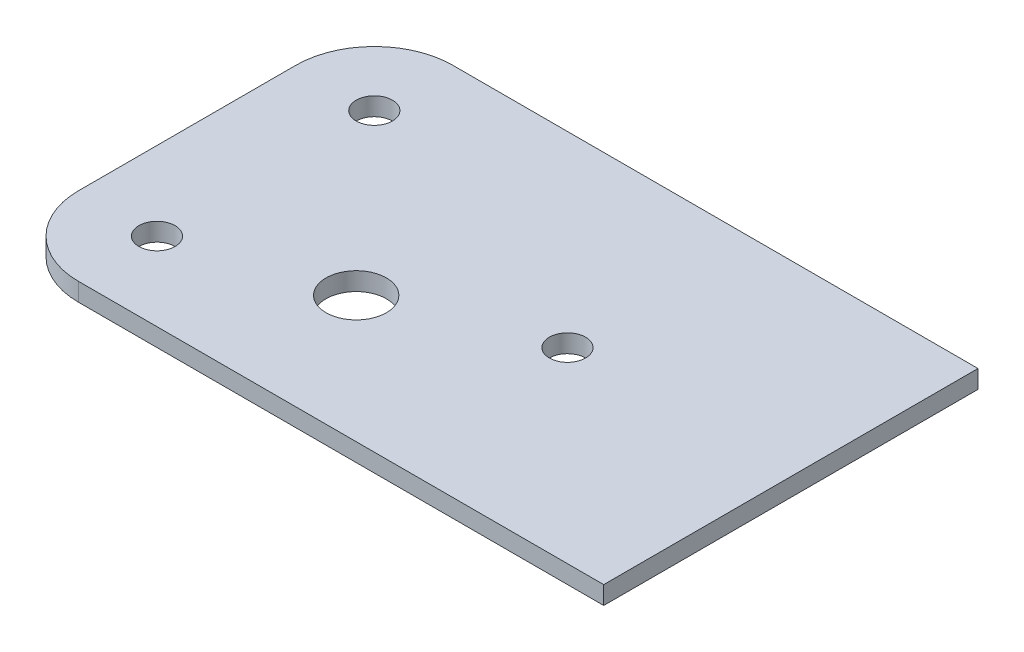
ISO-10303-21;
HEADER;
FILE_DESCRIPTION(('STEP AP214'),'2;1');
FILE_NAME('part.step','',(''),(''),'','','');
FILE_SCHEMA(('AUTOMOTIVE_DESIGN { 1 0 10303 214 1 1 1 1 }'));
ENDSEC;
DATA;
#1=APPLICATION_CONTEXT('core data for automotive mechanical design processes');
#2=APPLICATION_PROTOCOL_DEFINITION('international standard','automotive_design',2000,#1);
#3=PRODUCT_CONTEXT('',#1,'mechanical');
#4=PRODUCT('Part','Part','',(#3));
#5=PRODUCT_RELATED_PRODUCT_CATEGORY('part','',(#4));
#6=PRODUCT_DEFINITION_FORMATION('','',#4);
#7=PRODUCT_DEFINITION_CONTEXT('part definition',#1,'design');
#8=PRODUCT_DEFINITION('design','',#6,#7);
#9=PRODUCT_DEFINITION_SHAPE('','',#8);
#10=(LENGTH_UNIT() NAMED_UNIT(*) SI_UNIT(.MILLI.,.METRE.));
#11=(NAMED_UNIT(*) PLANE_ANGLE_UNIT() SI_UNIT($,.RADIAN.));
#12=(NAMED_UNIT(*) SI_UNIT($,.STERADIAN.) SOLID_ANGLE_UNIT());
#13=UNCERTAINTY_MEASURE_WITH_UNIT(LENGTH_MEASURE(1.E-05),#10,'distance_accuracy_value','');
#14=(GEOMETRIC_REPRESENTATION_CONTEXT(3) GLOBAL_UNCERTAINTY_ASSIGNED_CONTEXT((#13)) GLOBAL_UNIT_ASSIGNED_CONTEXT((#10,
#11,#12)) REPRESENTATION_CONTEXT('',''));
#15=CARTESIAN_POINT('',(0.,0.,0.));
#16=DIRECTION('',(0.,0.,1.));
#17=DIRECTION('',(1.,0.,0.));
#18=AXIS2_PLACEMENT_3D('',#15,#16,#17);
#19=CARTESIAN_POINT('',(13.,3.,-49.));
#20=DIRECTION('',(0.,-1.,0.));
#21=DIRECTION('',(0.,0.,-1.));
#22=AXIS2_PLACEMENT_3D('',#19,#20,#21);
#23=PLANE('',#22);
#24=CARTESIAN_POINT('',(38.,3.,-21.));
#25=DIRECTION('',(0.,1.,0.));
#26=DIRECTION('',(0.,0.,1.));
#27=AXIS2_PLACEMENT_3D('',#24,#25,#26);
#28=CIRCLE('',#27,5.);
#29=CARTESIAN_POINT('',(38.,3.,-16.));
#30=VERTEX_POINT('',#29);
#31=EDGE_CURVE('E196',#30,#30,#28,.T.);
#32=ORIENTED_EDGE('',*,*,#31,.F.);
#33=EDGE_LOOP('',(#32));
#34=FACE_BOUND('',#33,.T.);
#35=CARTESIAN_POINT('',(13.,3.,-49.));
#36=DIRECTION('',(0.,1.,0.));
#37=DIRECTION('',(0.,0.,1.));
#38=AXIS2_PLACEMENT_3D('',#35,#36,#37);
#39=CIRCLE('',#38,3.);
#40=CARTESIAN_POINT('',(13.,3.,-46.));
#41=VERTEX_POINT('',#40);
#42=EDGE_CURVE('E102',#41,#41,#39,.T.);
#43=ORIENTED_EDGE('',*,*,#42,.F.);
#44=EDGE_LOOP('',(#43));
#45=FACE_BOUND('',#44,.T.);
#46=DIRECTION('',(0.,0.,-1.));
#47=VECTOR('',#46,1.);
#48=CARTESIAN_POINT('',(100.,3.,0.));
#49=LINE('',#48,#47);
#50=CARTESIAN_POINT('',(100.,3.,0.));
#51=VERTEX_POINT('',#50);
#52=CARTESIAN_POINT('',(100.,3.,-62.));
#53=VERTEX_POINT('',#52);
#54=EDGE_CURVE('E116',#51,#53,#49,.T.);
#55=ORIENTED_EDGE('',*,*,#54,.T.);
#56=DIRECTION('',(-1.,0.,0.));
#57=VECTOR('',#56,1.);
#58=CARTESIAN_POINT('',(13.0000000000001,3.,-62.));
#59=LINE('',#58,#57);
#60=CARTESIAN_POINT('',(13.0000000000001,3.,-62.));
#61=VERTEX_POINT('',#60);
#62=EDGE_CURVE('E97',#53,#61,#59,.T.);
#63=ORIENTED_EDGE('',*,*,#62,.T.);
#64=CARTESIAN_POINT('',(13.,3.,-49.));
#65=DIRECTION('',(0.,1.,0.));
#66=DIRECTION('',(0.,0.,-1.));
#67=AXIS2_PLACEMENT_3D('',#64,#65,#66);
#68=CIRCLE('',#67,13.);
#69=CARTESIAN_POINT('',(0.,3.,-48.9999999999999));
#70=VERTEX_POINT('',#69);
#71=EDGE_CURVE('E119',#61,#70,#68,.T.);
#72=ORIENTED_EDGE('',*,*,#71,.T.);
#73=DIRECTION('',(0.,0.,1.));
#74=VECTOR('',#73,1.);
#75=CARTESIAN_POINT('',(0.,3.,-13.0000000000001));
#76=LINE('',#75,#74);
#77=CARTESIAN_POINT('',(0.,3.,-13.0000000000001));
#78=VERTEX_POINT('',#77);
#79=EDGE_CURVE('E121',#70,#78,#76,.T.);
#80=ORIENTED_EDGE('',*,*,#79,.T.);
#81=CARTESIAN_POINT('',(13.,3.,-13.));
#82=DIRECTION('',(0.,1.,0.));
#83=DIRECTION('',(0.,0.,-1.));
#84=AXIS2_PLACEMENT_3D('',#81,#82,#83);
#85=CIRCLE('',#84,13.);
#86=CARTESIAN_POINT('',(13.0000000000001,3.,0.));
#87=VERTEX_POINT('',#86);
#88=EDGE_CURVE('E50',#78,#87,#85,.T.);
#89=ORIENTED_EDGE('',*,*,#88,.T.);
#90=DIRECTION('',(1.,0.,0.));
#91=VECTOR('',#90,1.);
#92=CARTESIAN_POINT('',(13.0000000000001,3.,0.));
#93=LINE('',#92,#91);
#94=EDGE_CURVE('E45',#87,#51,#93,.T.);
#95=ORIENTED_EDGE('',*,*,#94,.T.);
#96=EDGE_LOOP('',(#55,#63,#72,#80,#89,#95));
#97=FACE_BOUND('',#96,.T.);
#98=CARTESIAN_POINT('',(13.,3.,-13.));
#99=DIRECTION('',(0.,1.,0.));
#100=DIRECTION('',(0.,0.,1.));
#101=AXIS2_PLACEMENT_3D('',#98,#99,#100);
#102=CIRCLE('',#101,3.);
#103=CARTESIAN_POINT('',(13.,3.,-10.));
#104=VERTEX_POINT('',#103);
#105=EDGE_CURVE('E202',#104,#104,#102,.T.);
#106=ORIENTED_EDGE('',*,*,#105,.F.);
#107=EDGE_LOOP('',(#106));
#108=FACE_BOUND('',#107,.T.);
#109=CARTESIAN_POINT('',(63.,3.,-31.));
#110=DIRECTION('',(0.,1.,0.));
#111=DIRECTION('',(0.,0.,1.));
#112=AXIS2_PLACEMENT_3D('',#109,#110,#111);
#113=CIRCLE('',#112,3.00000000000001);
#114=CARTESIAN_POINT('',(63.,3.,-28.));
#115=VERTEX_POINT('',#114);
#116=EDGE_CURVE('E185',#115,#115,#113,.T.);
#117=ORIENTED_EDGE('',*,*,#116,.F.);
#118=EDGE_LOOP('',(#117));
#119=FACE_BOUND('',#118,.T.);
#120=ADVANCED_FACE('F30',(#34,#45,#97,#108,#119),#23,.F.);
#121=CARTESIAN_POINT('',(13.,0.,-49.));
#122=DIRECTION('',(0.,-1.,0.));
#123=DIRECTION('',(0.,0.,-1.));
#124=AXIS2_PLACEMENT_3D('',#121,#122,#123);
#125=PLANE('',#124);
#126=CARTESIAN_POINT('',(38.,0.,-21.));
#127=DIRECTION('',(0.,1.,0.));
#128=DIRECTION('',(0.,0.,1.));
#129=AXIS2_PLACEMENT_3D('',#126,#127,#128);
#130=CIRCLE('',#129,5.);
#131=CARTESIAN_POINT('',(38.,0.,-16.));
#132=VERTEX_POINT('',#131);
#133=EDGE_CURVE('E191',#132,#132,#130,.T.);
#134=ORIENTED_EDGE('',*,*,#133,.T.);
#135=EDGE_LOOP('',(#134));
#136=FACE_BOUND('',#135,.T.);
#137=CARTESIAN_POINT('',(13.,0.,-49.));
#138=DIRECTION('',(0.,1.,0.));
#139=DIRECTION('',(0.,0.,1.));
#140=AXIS2_PLACEMENT_3D('',#137,#138,#139);
#141=CIRCLE('',#140,3.);
#142=CARTESIAN_POINT('',(13.,0.,-46.));
#143=VERTEX_POINT('',#142);
#144=EDGE_CURVE('E105',#143,#143,#141,.T.);
#145=ORIENTED_EDGE('',*,*,#144,.T.);
#146=EDGE_LOOP('',(#145));
#147=FACE_BOUND('',#146,.T.);
#148=DIRECTION('',(0.,0.,-1.));
#149=VECTOR('',#148,1.);
#150=CARTESIAN_POINT('',(100.,0.,0.));
#151=LINE('',#150,#149);
#152=CARTESIAN_POINT('',(100.,0.,0.));
#153=VERTEX_POINT('',#152);
#154=CARTESIAN_POINT('',(100.,0.,-62.));
#155=VERTEX_POINT('',#154);
#156=EDGE_CURVE('E88',#153,#155,#151,.T.);
#157=ORIENTED_EDGE('',*,*,#156,.F.);
#158=DIRECTION('',(1.,0.,0.));
#159=VECTOR('',#158,1.);
#160=CARTESIAN_POINT('',(13.0000000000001,0.,0.));
#161=LINE('',#160,#159);
#162=CARTESIAN_POINT('',(13.0000000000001,0.,0.));
#163=VERTEX_POINT('',#162);
#164=EDGE_CURVE('E114',#163,#153,#161,.T.);
#165=ORIENTED_EDGE('',*,*,#164,.F.);
#166=CARTESIAN_POINT('',(13.,0.,-13.));
#167=DIRECTION('',(0.,1.,0.));
#168=DIRECTION('',(0.,0.,-1.));
#169=AXIS2_PLACEMENT_3D('',#166,#167,#168);
#170=CIRCLE('',#169,13.);
#171=CARTESIAN_POINT('',(0.,0.,-13.0000000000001));
#172=VERTEX_POINT('',#171);
#173=EDGE_CURVE('E112',#172,#163,#170,.T.);
#174=ORIENTED_EDGE('',*,*,#173,.F.);
#175=DIRECTION('',(0.,0.,1.));
#176=VECTOR('',#175,1.);
#177=CARTESIAN_POINT('',(0.,0.,-13.0000000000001));
#178=LINE('',#177,#176);
#179=CARTESIAN_POINT('',(0.,0.,-48.9999999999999));
#180=VERTEX_POINT('',#179);
#181=EDGE_CURVE('E110',#180,#172,#178,.T.);
#182=ORIENTED_EDGE('',*,*,#181,.F.);
#183=CARTESIAN_POINT('',(13.,0.,-49.));
#184=DIRECTION('',(0.,1.,0.));
#185=DIRECTION('',(0.,0.,-1.));
#186=AXIS2_PLACEMENT_3D('',#183,#184,#185);
#187=CIRCLE('',#186,13.);
#188=CARTESIAN_POINT('',(13.0000000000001,0.,-62.));
#189=VERTEX_POINT('',#188);
#190=EDGE_CURVE('E90',#189,#180,#187,.T.);
#191=ORIENTED_EDGE('',*,*,#190,.F.);
#192=DIRECTION('',(-1.,0.,0.));
#193=VECTOR('',#192,1.);
#194=CARTESIAN_POINT('',(13.0000000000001,0.,-62.));
#195=LINE('',#194,#193);
#196=EDGE_CURVE('E83',#155,#189,#195,.T.);
#197=ORIENTED_EDGE('',*,*,#196,.F.);
#198=EDGE_LOOP('',(#157,#165,#174,#182,#191,#197));
#199=FACE_BOUND('',#198,.T.);
#200=CARTESIAN_POINT('',(13.,0.,-13.));
#201=DIRECTION('',(0.,1.,0.));
#202=DIRECTION('',(0.,0.,1.));
#203=AXIS2_PLACEMENT_3D('',#200,#201,#202);
#204=CIRCLE('',#203,3.);
#205=CARTESIAN_POINT('',(13.,0.,-10.));
#206=VERTEX_POINT('',#205);
#207=EDGE_CURVE('E199',#206,#206,#204,.T.);
#208=ORIENTED_EDGE('',*,*,#207,.T.);
#209=EDGE_LOOP('',(#208));
#210=FACE_BOUND('',#209,.T.);
#211=CARTESIAN_POINT('',(63.,0.,-31.));
#212=DIRECTION('',(0.,1.,0.));
#213=DIRECTION('',(0.,0.,1.));
#214=AXIS2_PLACEMENT_3D('',#211,#212,#213);
#215=CIRCLE('',#214,3.00000000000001);
#216=CARTESIAN_POINT('',(63.,0.,-28.));
#217=VERTEX_POINT('',#216);
#218=EDGE_CURVE('E188',#217,#217,#215,.T.);
#219=ORIENTED_EDGE('',*,*,#218,.T.);
#220=EDGE_LOOP('',(#219));
#221=FACE_BOUND('',#220,.T.);
#222=ADVANCED_FACE('F84',(#136,#147,#199,#210,#221),#125,.T.);
#223=CARTESIAN_POINT('',(100.,3.,0.));
#224=DIRECTION('',(-1.,0.,0.));
#225=DIRECTION('',(0.,0.,1.));
#226=AXIS2_PLACEMENT_3D('',#223,#224,#225);
#227=PLANE('',#226);
#228=ORIENTED_EDGE('',*,*,#156,.T.);
#229=DIRECTION('',(0.,-1.,0.));
#230=VECTOR('',#229,1.);
#231=CARTESIAN_POINT('',(100.,3.,-62.));
#232=LINE('',#231,#230);
#233=EDGE_CURVE('E11',#53,#155,#232,.T.);
#234=ORIENTED_EDGE('',*,*,#233,.F.);
#235=ORIENTED_EDGE('',*,*,#54,.F.);
#236=DIRECTION('',(0.,-1.,0.));
#237=VECTOR('',#236,1.);
#238=CARTESIAN_POINT('',(100.,3.,0.));
#239=LINE('',#238,#237);
#240=EDGE_CURVE('E101',#51,#153,#239,.T.);
#241=ORIENTED_EDGE('',*,*,#240,.T.);
#242=EDGE_LOOP('',(#228,#234,#235,#241));
#243=FACE_BOUND('',#242,.T.);
#244=ADVANCED_FACE('F32',(#243),#227,.F.);
#245=CARTESIAN_POINT('',(13.0000000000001,3.,-62.));
#246=DIRECTION('',(0.,0.,1.));
#247=DIRECTION('',(1.,0.,0.));
#248=AXIS2_PLACEMENT_3D('',#245,#246,#247);
#249=PLANE('',#248);
#250=ORIENTED_EDGE('',*,*,#196,.T.);
#251=DIRECTION('',(0.,-1.,0.));
#252=VECTOR('',#251,1.);
#253=CARTESIAN_POINT('',(13.0000000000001,3.,-62.));
#254=LINE('',#253,#252);
#255=EDGE_CURVE('E38',#61,#189,#254,.T.);
#256=ORIENTED_EDGE('',*,*,#255,.F.);
#257=ORIENTED_EDGE('',*,*,#62,.F.);
#258=ORIENTED_EDGE('',*,*,#233,.T.);
#259=EDGE_LOOP('',(#250,#256,#257,#258));
#260=FACE_BOUND('',#259,.T.);
#261=ADVANCED_FACE('F96',(#260),#249,.F.);
#262=CARTESIAN_POINT('',(13.,3.,-49.));
#263=DIRECTION('',(0.,-1.,0.));
#264=DIRECTION('',(0.,0.,-1.));
#265=AXIS2_PLACEMENT_3D('',#262,#263,#264);
#266=CYLINDRICAL_SURFACE('',#265,13.);
#267=ORIENTED_EDGE('',*,*,#190,.T.);
#268=DIRECTION('',(0.,-1.,0.));
#269=VECTOR('',#268,1.);
#270=CARTESIAN_POINT('',(0.,3.,-48.9999999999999));
#271=LINE('',#270,#269);
#272=EDGE_CURVE('E132',#70,#180,#271,.T.);
#273=ORIENTED_EDGE('',*,*,#272,.F.);
#274=ORIENTED_EDGE('',*,*,#71,.F.);
#275=ORIENTED_EDGE('',*,*,#255,.T.);
#276=EDGE_LOOP('',(#267,#273,#274,#275));
#277=FACE_BOUND('',#276,.T.);
#278=ADVANCED_FACE('F136',(#277),#266,.T.);
#279=CARTESIAN_POINT('',(0.,3.,-13.0000000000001));
#280=DIRECTION('',(1.,0.,0.));
#281=DIRECTION('',(0.,0.,-1.));
#282=AXIS2_PLACEMENT_3D('',#279,#280,#281);
#283=PLANE('',#282);
#284=ORIENTED_EDGE('',*,*,#181,.T.);
#285=DIRECTION('',(0.,-1.,0.));
#286=VECTOR('',#285,1.);
#287=CARTESIAN_POINT('',(0.,3.,-13.0000000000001));
#288=LINE('',#287,#286);
#289=EDGE_CURVE('E129',#78,#172,#288,.T.);
#290=ORIENTED_EDGE('',*,*,#289,.F.);
#291=ORIENTED_EDGE('',*,*,#79,.F.);
#292=ORIENTED_EDGE('',*,*,#272,.T.);
#293=EDGE_LOOP('',(#284,#290,#291,#292));
#294=FACE_BOUND('',#293,.T.);
#295=ADVANCED_FACE('F142',(#294),#283,.F.);
#296=CARTESIAN_POINT('',(13.,3.,-13.));
#297=DIRECTION('',(0.,-1.,0.));
#298=DIRECTION('',(0.,0.,-1.));
#299=AXIS2_PLACEMENT_3D('',#296,#297,#298);
#300=CYLINDRICAL_SURFACE('',#299,13.);
#301=ORIENTED_EDGE('',*,*,#173,.T.);
#302=DIRECTION('',(0.,-1.,0.));
#303=VECTOR('',#302,1.);
#304=CARTESIAN_POINT('',(13.0000000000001,3.,0.));
#305=LINE('',#304,#303);
#306=EDGE_CURVE('E126',#87,#163,#305,.T.);
#307=ORIENTED_EDGE('',*,*,#306,.F.);
#308=ORIENTED_EDGE('',*,*,#88,.F.);
#309=ORIENTED_EDGE('',*,*,#289,.T.);
#310=EDGE_LOOP('',(#301,#307,#308,#309));
#311=FACE_BOUND('',#310,.T.);
#312=ADVANCED_FACE('F145',(#311),#300,.T.);
#313=CARTESIAN_POINT('',(13.0000000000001,3.,0.));
#314=DIRECTION('',(0.,0.,-1.));
#315=DIRECTION('',(-1.,0.,0.));
#316=AXIS2_PLACEMENT_3D('',#313,#314,#315);
#317=PLANE('',#316);
#318=ORIENTED_EDGE('',*,*,#164,.T.);
#319=ORIENTED_EDGE('',*,*,#240,.F.);
#320=ORIENTED_EDGE('',*,*,#94,.F.);
#321=ORIENTED_EDGE('',*,*,#306,.T.);
#322=EDGE_LOOP('',(#318,#319,#320,#321));
#323=FACE_BOUND('',#322,.T.);
#324=ADVANCED_FACE('F147',(#323),#317,.F.);
#325=CARTESIAN_POINT('',(13.,3.,-49.));
#326=DIRECTION('',(0.,-1.,0.));
#327=DIRECTION('',(0.,0.,-1.));
#328=AXIS2_PLACEMENT_3D('',#325,#326,#327);
#329=CYLINDRICAL_SURFACE('',#328,3.);
#330=ORIENTED_EDGE('',*,*,#42,.T.);
#331=EDGE_LOOP('',(#330));
#332=FACE_BOUND('',#331,.T.);
#333=ORIENTED_EDGE('',*,*,#144,.F.);
#334=EDGE_LOOP('',(#333));
#335=FACE_BOUND('',#334,.T.);
#336=ADVANCED_FACE('F149',(#332,#335),#329,.F.);
#337=CARTESIAN_POINT('',(13.,3.,-13.));
#338=DIRECTION('',(0.,-1.,0.));
#339=DIRECTION('',(0.,0.,-1.));
#340=AXIS2_PLACEMENT_3D('',#337,#338,#339);
#341=CYLINDRICAL_SURFACE('',#340,3.);
#342=ORIENTED_EDGE('',*,*,#105,.T.);
#343=EDGE_LOOP('',(#342));
#344=FACE_BOUND('',#343,.T.);
#345=ORIENTED_EDGE('',*,*,#207,.F.);
#346=EDGE_LOOP('',(#345));
#347=FACE_BOUND('',#346,.T.);
#348=ADVANCED_FACE('F155',(#344,#347),#341,.F.);
#349=CARTESIAN_POINT('',(38.,3.,-21.));
#350=DIRECTION('',(0.,-1.,0.));
#351=DIRECTION('',(0.,0.,-1.));
#352=AXIS2_PLACEMENT_3D('',#349,#350,#351);
#353=CYLINDRICAL_SURFACE('',#352,5.);
#354=ORIENTED_EDGE('',*,*,#31,.T.);
#355=EDGE_LOOP('',(#354));
#356=FACE_BOUND('',#355,.T.);
#357=ORIENTED_EDGE('',*,*,#133,.F.);
#358=EDGE_LOOP('',(#357));
#359=FACE_BOUND('',#358,.T.);
#360=ADVANCED_FACE('F172',(#356,#359),#353,.F.);
#361=CARTESIAN_POINT('',(63.,3.,-31.));
#362=DIRECTION('',(0.,-1.,0.));
#363=DIRECTION('',(0.,0.,-1.));
#364=AXIS2_PLACEMENT_3D('',#361,#362,#363);
#365=CYLINDRICAL_SURFACE('',#364,3.00000000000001);
#366=ORIENTED_EDGE('',*,*,#116,.T.);
#367=EDGE_LOOP('',(#366));
#368=FACE_BOUND('',#367,.T.);
#369=ORIENTED_EDGE('',*,*,#218,.F.);
#370=EDGE_LOOP('',(#369));
#371=FACE_BOUND('',#370,.T.);
#372=ADVANCED_FACE('F176',(#368,#371),#365,.F.);
#373=CLOSED_SHELL('',(#120,#222,#244,#261,#278,#295,#312,#324,#336,#348,#360,#372));
#374=MANIFOLD_SOLID_BREP('B2',#373);
#375=ADVANCED_BREP_SHAPE_REPRESENTATION('',(#18,#374),#14);
#376=SHAPE_DEFINITION_REPRESENTATION(#9,#375);
ENDSEC;
END-ISO-10303-21;
